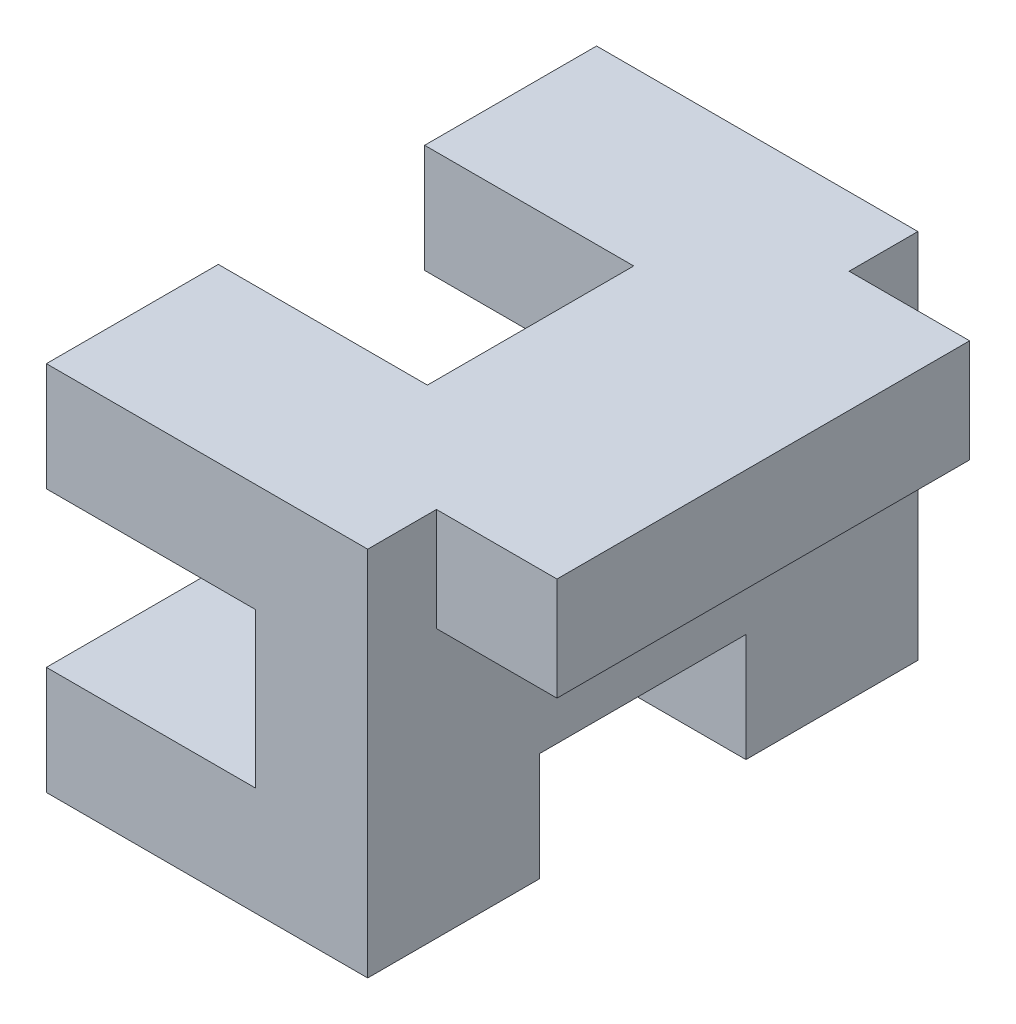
ISO-10303-21;
HEADER;
FILE_DESCRIPTION(('STEP AP214'),'2;1');
FILE_NAME('part.step','',(''),(''),'','','');
FILE_SCHEMA(('AUTOMOTIVE_DESIGN { 1 0 10303 214 1 1 1 1 }'));
ENDSEC;
DATA;
#1=APPLICATION_CONTEXT('core data for automotive mechanical design processes');
#2=APPLICATION_PROTOCOL_DEFINITION('international standard','automotive_design',2000,#1);
#3=PRODUCT_CONTEXT('',#1,'mechanical');
#4=PRODUCT('Part','Part','',(#3));
#5=PRODUCT_RELATED_PRODUCT_CATEGORY('part','',(#4));
#6=PRODUCT_DEFINITION_FORMATION('','',#4);
#7=PRODUCT_DEFINITION_CONTEXT('part definition',#1,'design');
#8=PRODUCT_DEFINITION('design','',#6,#7);
#9=PRODUCT_DEFINITION_SHAPE('','',#8);
#10=(LENGTH_UNIT() NAMED_UNIT(*) SI_UNIT(.MILLI.,.METRE.));
#11=(NAMED_UNIT(*) PLANE_ANGLE_UNIT() SI_UNIT($,.RADIAN.));
#12=(NAMED_UNIT(*) SI_UNIT($,.STERADIAN.) SOLID_ANGLE_UNIT());
#13=UNCERTAINTY_MEASURE_WITH_UNIT(LENGTH_MEASURE(1.E-05),#10,'distance_accuracy_value','');
#14=(GEOMETRIC_REPRESENTATION_CONTEXT(3) GLOBAL_UNCERTAINTY_ASSIGNED_CONTEXT((#13)) GLOBAL_UNIT_ASSIGNED_CONTEXT((#10,
#11,#12)) REPRESENTATION_CONTEXT('',''));
#15=CARTESIAN_POINT('',(0.,0.,0.));
#16=DIRECTION('',(0.,0.,1.));
#17=DIRECTION('',(1.,0.,0.));
#18=AXIS2_PLACEMENT_3D('',#15,#16,#17);
#19=CARTESIAN_POINT('',(-30.1752,-17.145,25.4));
#20=DIRECTION('',(0.,1.,0.));
#21=DIRECTION('',(0.,0.,1.));
#22=AXIS2_PLACEMENT_3D('',#19,#20,#21);
#23=PLANE('',#22);
#24=DIRECTION('',(-1.,0.,0.));
#25=VECTOR('',#24,1.);
#26=CARTESIAN_POINT('',(-30.1752,-17.145,-9.525));
#27=LINE('',#26,#25);
#28=CARTESIAN_POINT('',(0.,-17.145,-9.525));
#29=VERTEX_POINT('',#28);
#30=CARTESIAN_POINT('',(-29.6672,-17.145,-9.525));
#31=VERTEX_POINT('',#30);
#32=EDGE_CURVE('E375',#29,#31,#27,.T.);
#33=ORIENTED_EDGE('',*,*,#32,.T.);
#34=DIRECTION('',(0.,0.,-1.));
#35=VECTOR('',#34,1.);
#36=CARTESIAN_POINT('',(-29.6672,-17.145,25.4));
#37=LINE('',#36,#35);
#38=CARTESIAN_POINT('',(-29.6672,-17.145,-25.4));
#39=VERTEX_POINT('',#38);
#40=EDGE_CURVE('E312',#31,#39,#37,.T.);
#41=ORIENTED_EDGE('',*,*,#40,.T.);
#42=DIRECTION('',(1.,0.,0.));
#43=VECTOR('',#42,1.);
#44=CARTESIAN_POINT('',(-30.1752,-17.145,-25.4));
#45=LINE('',#44,#43);
#46=CARTESIAN_POINT('',(0.,-17.145,-25.4));
#47=VERTEX_POINT('',#46);
#48=EDGE_CURVE('E237',#39,#47,#45,.T.);
#49=ORIENTED_EDGE('',*,*,#48,.T.);
#50=DIRECTION('',(0.,0.,-1.));
#51=VECTOR('',#50,1.);
#52=CARTESIAN_POINT('',(0.,-17.145,25.4));
#53=LINE('',#52,#51);
#54=EDGE_CURVE('E231',#29,#47,#53,.T.);
#55=ORIENTED_EDGE('',*,*,#54,.F.);
#56=EDGE_LOOP('',(#33,#41,#49,#55));
#57=FACE_BOUND('',#56,.T.);
#58=ADVANCED_FACE('F32',(#57),#23,.F.);
#59=CARTESIAN_POINT('',(-30.1752,17.145,25.4));
#60=DIRECTION('',(1.,0.,0.));
#61=DIRECTION('',(0.,1.,0.));
#62=AXIS2_PLACEMENT_3D('',#59,#60,#61);
#63=PLANE('',#62);
#64=DIRECTION('',(0.,0.,-1.));
#65=VECTOR('',#64,1.);
#66=CARTESIAN_POINT('',(-30.1752,16.637,25.4));
#67=LINE('',#66,#65);
#68=CARTESIAN_POINT('',(-30.1752,16.637,-10.033));
#69=VERTEX_POINT('',#68);
#70=CARTESIAN_POINT('',(-30.1752,16.637,-24.892));
#71=VERTEX_POINT('',#70);
#72=EDGE_CURVE('E318',#69,#71,#67,.T.);
#73=ORIENTED_EDGE('',*,*,#72,.T.);
#74=DIRECTION('',(0.,-1.,0.));
#75=VECTOR('',#74,1.);
#76=CARTESIAN_POINT('',(-30.1752,7.13739999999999,-24.892));
#77=LINE('',#76,#75);
#78=CARTESIAN_POINT('',(-30.1752,7.6454,-24.892));
#79=VERTEX_POINT('',#78);
#80=EDGE_CURVE('E320',#71,#79,#77,.T.);
#81=ORIENTED_EDGE('',*,*,#80,.T.);
#82=DIRECTION('',(0.,0.,1.));
#83=VECTOR('',#82,1.);
#84=CARTESIAN_POINT('',(-30.1752,7.6454,25.4));
#85=LINE('',#84,#83);
#86=CARTESIAN_POINT('',(-30.1752,7.6454,-10.033));
#87=VERTEX_POINT('',#86);
#88=EDGE_CURVE('E314',#79,#87,#85,.T.);
#89=ORIENTED_EDGE('',*,*,#88,.T.);
#90=DIRECTION('',(0.,1.,0.));
#91=VECTOR('',#90,1.);
#92=CARTESIAN_POINT('',(-30.1752,17.145,-10.033));
#93=LINE('',#92,#91);
#94=EDGE_CURVE('E316',#87,#69,#93,.T.);
#95=ORIENTED_EDGE('',*,*,#94,.T.);
#96=EDGE_LOOP('',(#73,#81,#89,#95));
#97=FACE_BOUND('',#96,.T.);
#98=ADVANCED_FACE('F500',(#97),#63,.F.);
#99=CARTESIAN_POINT('',(-30.1752,7.13739999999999,25.4));
#100=DIRECTION('',(0.,1.,0.));
#101=DIRECTION('',(0.,0.,1.));
#102=AXIS2_PLACEMENT_3D('',#99,#100,#101);
#103=PLANE('',#102);
#104=DIRECTION('',(-1.,0.,0.));
#105=VECTOR('',#104,1.);
#106=CARTESIAN_POINT('',(-30.1752,7.13739999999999,-9.52499999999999));
#107=LINE('',#106,#105);
#108=CARTESIAN_POINT('',(-10.3632,7.1374,-9.525));
#109=VERTEX_POINT('',#108);
#110=CARTESIAN_POINT('',(-29.6672,7.13739999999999,-9.52499999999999));
#111=VERTEX_POINT('',#110);
#112=EDGE_CURVE('E251',#109,#111,#107,.T.);
#113=ORIENTED_EDGE('',*,*,#112,.T.);
#114=DIRECTION('',(0.,0.,-1.));
#115=VECTOR('',#114,1.);
#116=CARTESIAN_POINT('',(-29.6672000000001,7.13739999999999,25.4));
#117=LINE('',#116,#115);
#118=CARTESIAN_POINT('',(-29.6672,7.13739999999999,-25.4));
#119=VERTEX_POINT('',#118);
#120=EDGE_CURVE('E330',#111,#119,#117,.T.);
#121=ORIENTED_EDGE('',*,*,#120,.T.);
#122=DIRECTION('',(1.,0.,0.));
#123=VECTOR('',#122,1.);
#124=CARTESIAN_POINT('',(-30.1752,7.13739999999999,-25.4));
#125=LINE('',#124,#123);
#126=CARTESIAN_POINT('',(-10.3632,7.1374,-25.4));
#127=VERTEX_POINT('',#126);
#128=EDGE_CURVE('E250',#119,#127,#125,.T.);
#129=ORIENTED_EDGE('',*,*,#128,.T.);
#130=DIRECTION('',(0.,0.,-1.));
#131=VECTOR('',#130,1.);
#132=CARTESIAN_POINT('',(-10.3632,7.1374,25.4));
#133=LINE('',#132,#131);
#134=EDGE_CURVE('E291',#109,#127,#133,.T.);
#135=ORIENTED_EDGE('',*,*,#134,.F.);
#136=EDGE_LOOP('',(#113,#121,#129,#135));
#137=FACE_BOUND('',#136,.T.);
#138=ADVANCED_FACE('F505',(#137),#103,.F.);
#139=CARTESIAN_POINT('',(-10.3632,-7.13740000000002,25.4));
#140=DIRECTION('',(0.,-1.,0.));
#141=DIRECTION('',(1.,0.,0.));
#142=AXIS2_PLACEMENT_3D('',#139,#140,#141);
#143=PLANE('',#142);
#144=DIRECTION('',(-1.,0.,0.));
#145=VECTOR('',#144,1.);
#146=CARTESIAN_POINT('',(-10.3632,-7.13740000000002,-25.4));
#147=LINE('',#146,#145);
#148=CARTESIAN_POINT('',(-10.3632,-7.13740000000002,-25.4));
#149=VERTEX_POINT('',#148);
#150=CARTESIAN_POINT('',(-29.6672,-7.13740000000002,-25.4));
#151=VERTEX_POINT('',#150);
#152=EDGE_CURVE('E262',#149,#151,#147,.T.);
#153=ORIENTED_EDGE('',*,*,#152,.T.);
#154=DIRECTION('',(0.,0.,1.));
#155=VECTOR('',#154,1.);
#156=CARTESIAN_POINT('',(-29.6672,-7.13740000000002,25.4));
#157=LINE('',#156,#155);
#158=CARTESIAN_POINT('',(-29.6672,-7.13740000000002,-9.52499999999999));
#159=VERTEX_POINT('',#158);
#160=EDGE_CURVE('E308',#151,#159,#157,.T.);
#161=ORIENTED_EDGE('',*,*,#160,.T.);
#162=DIRECTION('',(1.,0.,0.));
#163=VECTOR('',#162,1.);
#164=CARTESIAN_POINT('',(-10.3632,-7.13740000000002,-9.525));
#165=LINE('',#164,#163);
#166=CARTESIAN_POINT('',(-10.3632,-7.13740000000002,-9.525));
#167=VERTEX_POINT('',#166);
#168=EDGE_CURVE('E256',#159,#167,#165,.T.);
#169=ORIENTED_EDGE('',*,*,#168,.T.);
#170=DIRECTION('',(0.,0.,-1.));
#171=VECTOR('',#170,1.);
#172=CARTESIAN_POINT('',(-10.3632,-7.13740000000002,25.4));
#173=LINE('',#172,#171);
#174=EDGE_CURVE('E287',#167,#149,#173,.T.);
#175=ORIENTED_EDGE('',*,*,#174,.T.);
#176=EDGE_LOOP('',(#153,#161,#169,#175));
#177=FACE_BOUND('',#176,.T.);
#178=ADVANCED_FACE('F460',(#177),#143,.F.);
#179=CARTESIAN_POINT('',(-30.1752,-7.13740000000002,25.4));
#180=DIRECTION('',(1.,0.,0.));
#181=DIRECTION('',(0.,1.,0.));
#182=AXIS2_PLACEMENT_3D('',#179,#180,#181);
#183=PLANE('',#182);
#184=DIRECTION('',(0.,0.,-1.));
#185=VECTOR('',#184,1.);
#186=CARTESIAN_POINT('',(-30.1752,-7.64540000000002,25.4));
#187=LINE('',#186,#185);
#188=CARTESIAN_POINT('',(-30.1752,-7.64540000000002,-10.033));
#189=VERTEX_POINT('',#188);
#190=CARTESIAN_POINT('',(-30.1752,-7.64540000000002,-24.892));
#191=VERTEX_POINT('',#190);
#192=EDGE_CURVE('E299',#189,#191,#187,.T.);
#193=ORIENTED_EDGE('',*,*,#192,.T.);
#194=DIRECTION('',(0.,-1.,0.));
#195=VECTOR('',#194,1.);
#196=CARTESIAN_POINT('',(-30.1752,-17.145,-24.892));
#197=LINE('',#196,#195);
#198=CARTESIAN_POINT('',(-30.1752,-16.637,-24.892));
#199=VERTEX_POINT('',#198);
#200=EDGE_CURVE('E301',#191,#199,#197,.T.);
#201=ORIENTED_EDGE('',*,*,#200,.T.);
#202=DIRECTION('',(0.,0.,1.));
#203=VECTOR('',#202,1.);
#204=CARTESIAN_POINT('',(-30.1752,-16.637,25.4));
#205=LINE('',#204,#203);
#206=CARTESIAN_POINT('',(-30.1752,-16.637,-10.033));
#207=VERTEX_POINT('',#206);
#208=EDGE_CURVE('E295',#199,#207,#205,.T.);
#209=ORIENTED_EDGE('',*,*,#208,.T.);
#210=DIRECTION('',(0.,1.,0.));
#211=VECTOR('',#210,1.);
#212=CARTESIAN_POINT('',(-30.1752,-7.13740000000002,-10.033));
#213=LINE('',#212,#211);
#214=EDGE_CURVE('E297',#207,#189,#213,.T.);
#215=ORIENTED_EDGE('',*,*,#214,.T.);
#216=EDGE_LOOP('',(#193,#201,#209,#215));
#217=FACE_BOUND('',#216,.T.);
#218=ADVANCED_FACE('F491',(#217),#183,.F.);
#219=CARTESIAN_POINT('',(11.1252,17.145,25.4));
#220=DIRECTION('',(0.,-1.,0.));
#221=DIRECTION('',(1.,0.,0.));
#222=AXIS2_PLACEMENT_3D('',#219,#220,#221);
#223=PLANE('',#222);
#224=DIRECTION('',(0.,0.,-1.));
#225=VECTOR('',#224,1.);
#226=CARTESIAN_POINT('',(11.1252,17.145,25.4));
#227=LINE('',#226,#225);
#228=CARTESIAN_POINT('',(11.1252,17.145,19.05));
#229=VERTEX_POINT('',#228);
#230=CARTESIAN_POINT('',(11.1252,17.145,-19.05));
#231=VERTEX_POINT('',#230);
#232=EDGE_CURVE('E277',#229,#231,#227,.T.);
#233=ORIENTED_EDGE('',*,*,#232,.T.);
#234=DIRECTION('',(1.,0.,0.));
#235=VECTOR('',#234,1.);
#236=CARTESIAN_POINT('',(11.1252,17.145,-19.05));
#237=LINE('',#236,#235);
#238=CARTESIAN_POINT('',(0.,17.145,-19.05));
#239=VERTEX_POINT('',#238);
#240=EDGE_CURVE('E243',#239,#231,#237,.T.);
#241=ORIENTED_EDGE('',*,*,#240,.F.);
#242=DIRECTION('',(0.,0.,1.));
#243=VECTOR('',#242,1.);
#244=CARTESIAN_POINT('',(0.,17.145,-25.4));
#245=LINE('',#244,#243);
#246=CARTESIAN_POINT('',(0.,17.145,-25.4));
#247=VERTEX_POINT('',#246);
#248=EDGE_CURVE('E227',#247,#239,#245,.T.);
#249=ORIENTED_EDGE('',*,*,#248,.F.);
#250=DIRECTION('',(-1.,0.,0.));
#251=VECTOR('',#250,1.);
#252=CARTESIAN_POINT('',(11.1252,17.145,-25.4));
#253=LINE('',#252,#251);
#254=CARTESIAN_POINT('',(-29.6672,17.145,-25.4));
#255=VERTEX_POINT('',#254);
#256=EDGE_CURVE('E241',#247,#255,#253,.T.);
#257=ORIENTED_EDGE('',*,*,#256,.T.);
#258=DIRECTION('',(0.,0.,1.));
#259=VECTOR('',#258,1.);
#260=CARTESIAN_POINT('',(-29.6672000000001,17.145,25.4));
#261=LINE('',#260,#259);
#262=CARTESIAN_POINT('',(-29.6672,17.145,-9.525));
#263=VERTEX_POINT('',#262);
#264=EDGE_CURVE('E326',#255,#263,#261,.T.);
#265=ORIENTED_EDGE('',*,*,#264,.T.);
#266=DIRECTION('',(-1.,0.,0.));
#267=VECTOR('',#266,1.);
#268=CARTESIAN_POINT('',(-30.1752,17.145,-9.525));
#269=LINE('',#268,#267);
#270=CARTESIAN_POINT('',(-10.3632,17.145,-9.525));
#271=VERTEX_POINT('',#270);
#272=EDGE_CURVE('E376',#271,#263,#269,.T.);
#273=ORIENTED_EDGE('',*,*,#272,.F.);
#274=DIRECTION('',(0.,0.,-1.));
#275=VECTOR('',#274,1.);
#276=CARTESIAN_POINT('',(-10.3632,17.145,-9.525));
#277=LINE('',#276,#275);
#278=CARTESIAN_POINT('',(-10.3632,17.145,9.525));
#279=VERTEX_POINT('',#278);
#280=EDGE_CURVE('E442',#279,#271,#277,.T.);
#281=ORIENTED_EDGE('',*,*,#280,.F.);
#282=DIRECTION('',(1.,0.,0.));
#283=VECTOR('',#282,1.);
#284=CARTESIAN_POINT('',(-30.1752,17.145,9.52500000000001));
#285=LINE('',#284,#283);
#286=CARTESIAN_POINT('',(-29.6672,17.145,9.52500000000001));
#287=VERTEX_POINT('',#286);
#288=EDGE_CURVE('E440',#287,#279,#285,.T.);
#289=ORIENTED_EDGE('',*,*,#288,.F.);
#290=DIRECTION('',(0.,0.,1.));
#291=VECTOR('',#290,1.);
#292=CARTESIAN_POINT('',(-29.6672,17.145,25.4));
#293=LINE('',#292,#291);
#294=CARTESIAN_POINT('',(-29.6672000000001,17.145,25.4));
#295=VERTEX_POINT('',#294);
#296=EDGE_CURVE('E323',#287,#295,#293,.T.);
#297=ORIENTED_EDGE('',*,*,#296,.T.);
#298=DIRECTION('',(-1.,0.,0.));
#299=VECTOR('',#298,1.);
#300=CARTESIAN_POINT('',(11.1252,17.145,25.4));
#301=LINE('',#300,#299);
#302=CARTESIAN_POINT('',(0.,17.145,25.4));
#303=VERTEX_POINT('',#302);
#304=EDGE_CURVE('E236',#303,#295,#301,.T.);
#305=ORIENTED_EDGE('',*,*,#304,.F.);
#306=DIRECTION('',(0.,0.,1.));
#307=VECTOR('',#306,1.);
#308=CARTESIAN_POINT('',(0.,17.145,25.4));
#309=LINE('',#308,#307);
#310=CARTESIAN_POINT('',(0.,17.145,19.05));
#311=VERTEX_POINT('',#310);
#312=EDGE_CURVE('E579',#311,#303,#309,.T.);
#313=ORIENTED_EDGE('',*,*,#312,.F.);
#314=DIRECTION('',(-1.,0.,0.));
#315=VECTOR('',#314,1.);
#316=CARTESIAN_POINT('',(11.1252,17.145,19.05));
#317=LINE('',#316,#315);
#318=EDGE_CURVE('E582',#229,#311,#317,.T.);
#319=ORIENTED_EDGE('',*,*,#318,.F.);
#320=EDGE_LOOP('',(#233,#241,#249,#257,#265,#273,#281,#289,#297,#305,#313,#319));
#321=FACE_BOUND('',#320,.T.);
#322=ADVANCED_FACE('F34',(#321),#223,.F.);
#323=DIRECTION('',(0.,0.,1.));
#324=VECTOR('',#323,1.);
#325=CARTESIAN_POINT('',(-30.1752,7.6454,25.4));
#326=LINE('',#325,#324);
#327=CARTESIAN_POINT('',(-30.1752,7.6454,10.033));
#328=VERTEX_POINT('',#327);
#329=CARTESIAN_POINT('',(-30.1752,7.6454,24.892));
#330=VERTEX_POINT('',#329);
#331=EDGE_CURVE('E342',#328,#330,#326,.T.);
#332=ORIENTED_EDGE('',*,*,#331,.T.);
#333=DIRECTION('',(0.,1.,0.));
#334=VECTOR('',#333,1.);
#335=CARTESIAN_POINT('',(-30.1752,17.145,24.892));
#336=LINE('',#335,#334);
#337=CARTESIAN_POINT('',(-30.1752,16.637,24.892));
#338=VERTEX_POINT('',#337);
#339=EDGE_CURVE('E344',#330,#338,#336,.T.);
#340=ORIENTED_EDGE('',*,*,#339,.T.);
#341=DIRECTION('',(0.,0.,-1.));
#342=VECTOR('',#341,1.);
#343=CARTESIAN_POINT('',(-30.1752,16.637,25.4));
#344=LINE('',#343,#342);
#345=CARTESIAN_POINT('',(-30.1752,16.637,10.033));
#346=VERTEX_POINT('',#345);
#347=EDGE_CURVE('E338',#338,#346,#344,.T.);
#348=ORIENTED_EDGE('',*,*,#347,.T.);
#349=DIRECTION('',(0.,-1.,0.));
#350=VECTOR('',#349,1.);
#351=CARTESIAN_POINT('',(-30.1752,17.145,10.033));
#352=LINE('',#351,#350);
#353=EDGE_CURVE('E340',#346,#328,#352,.T.);
#354=ORIENTED_EDGE('',*,*,#353,.T.);
#355=EDGE_LOOP('',(#332,#340,#348,#354));
#356=FACE_BOUND('',#355,.T.);
#357=ADVANCED_FACE('F507',(#356),#63,.F.);
#358=DIRECTION('',(1.,0.,0.));
#359=VECTOR('',#358,1.);
#360=CARTESIAN_POINT('',(-30.1752,7.13739999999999,25.4));
#361=LINE('',#360,#359);
#362=CARTESIAN_POINT('',(-29.6672,7.13739999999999,25.4));
#363=VERTEX_POINT('',#362);
#364=CARTESIAN_POINT('',(-10.3632,7.1374,25.4));
#365=VERTEX_POINT('',#364);
#366=EDGE_CURVE('E267',#363,#365,#361,.T.);
#367=ORIENTED_EDGE('',*,*,#366,.F.);
#368=DIRECTION('',(0.,0.,-1.));
#369=VECTOR('',#368,1.);
#370=CARTESIAN_POINT('',(-29.6672000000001,7.13739999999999,25.4));
#371=LINE('',#370,#369);
#372=CARTESIAN_POINT('',(-29.6672,7.13739999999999,9.52500000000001));
#373=VERTEX_POINT('',#372);
#374=EDGE_CURVE('E347',#363,#373,#371,.T.);
#375=ORIENTED_EDGE('',*,*,#374,.T.);
#376=DIRECTION('',(1.,0.,0.));
#377=VECTOR('',#376,1.);
#378=CARTESIAN_POINT('',(-30.1752,7.13739999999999,9.52500000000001));
#379=LINE('',#378,#377);
#380=CARTESIAN_POINT('',(-10.3632,7.1374,9.525));
#381=VERTEX_POINT('',#380);
#382=EDGE_CURVE('E456',#373,#381,#379,.T.);
#383=ORIENTED_EDGE('',*,*,#382,.T.);
#384=EDGE_CURVE('E292',#365,#381,#133,.T.);
#385=ORIENTED_EDGE('',*,*,#384,.F.);
#386=EDGE_LOOP('',(#367,#375,#383,#385));
#387=FACE_BOUND('',#386,.T.);
#388=ADVANCED_FACE('F534',(#387),#103,.F.);
#389=CARTESIAN_POINT('',(-10.3632,7.1374,25.4));
#390=DIRECTION('',(1.,0.,0.));
#391=DIRECTION('',(0.,1.,0.));
#392=AXIS2_PLACEMENT_3D('',#389,#390,#391);
#393=PLANE('',#392);
#394=ORIENTED_EDGE('',*,*,#174,.F.);
#395=DIRECTION('',(0.,0.,1.));
#396=VECTOR('',#395,1.);
#397=CARTESIAN_POINT('',(-10.3632,-7.13740000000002,25.4));
#398=LINE('',#397,#396);
#399=CARTESIAN_POINT('',(-10.3632,-7.13740000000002,9.525));
#400=VERTEX_POINT('',#399);
#401=EDGE_CURVE('E435',#167,#400,#398,.T.);
#402=ORIENTED_EDGE('',*,*,#401,.T.);
#403=CARTESIAN_POINT('',(-10.3632,-7.13740000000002,25.4));
#404=VERTEX_POINT('',#403);
#405=EDGE_CURVE('E288',#404,#400,#173,.T.);
#406=ORIENTED_EDGE('',*,*,#405,.F.);
#407=DIRECTION('',(0.,-1.,0.));
#408=VECTOR('',#407,1.);
#409=CARTESIAN_POINT('',(-10.3632,7.1374,25.4));
#410=LINE('',#409,#408);
#411=EDGE_CURVE('E269',#365,#404,#410,.T.);
#412=ORIENTED_EDGE('',*,*,#411,.F.);
#413=ORIENTED_EDGE('',*,*,#384,.T.);
#414=DIRECTION('',(0.,1.,0.));
#415=VECTOR('',#414,1.);
#416=CARTESIAN_POINT('',(-10.3632,-17.145,9.525));
#417=LINE('',#416,#415);
#418=EDGE_CURVE('E449',#381,#279,#417,.T.);
#419=ORIENTED_EDGE('',*,*,#418,.T.);
#420=ORIENTED_EDGE('',*,*,#280,.T.);
#421=DIRECTION('',(0.,1.,0.));
#422=VECTOR('',#421,1.);
#423=CARTESIAN_POINT('',(-10.3632,-17.145,-9.525));
#424=LINE('',#423,#422);
#425=EDGE_CURVE('E450',#109,#271,#424,.T.);
#426=ORIENTED_EDGE('',*,*,#425,.F.);
#427=ORIENTED_EDGE('',*,*,#134,.T.);
#428=DIRECTION('',(0.,-1.,0.));
#429=VECTOR('',#428,1.);
#430=CARTESIAN_POINT('',(-10.3632,7.1374,-25.4));
#431=LINE('',#430,#429);
#432=EDGE_CURVE('E253',#127,#149,#431,.T.);
#433=ORIENTED_EDGE('',*,*,#432,.T.);
#434=EDGE_LOOP('',(#394,#402,#406,#412,#413,#419,#420,#426,#427,#433));
#435=FACE_BOUND('',#434,.T.);
#436=ADVANCED_FACE('F472',(#435),#393,.F.);
#437=DIRECTION('',(-1.,0.,0.));
#438=VECTOR('',#437,1.);
#439=CARTESIAN_POINT('',(-10.3632,-7.13740000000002,9.525));
#440=LINE('',#439,#438);
#441=CARTESIAN_POINT('',(-29.6672,-7.13740000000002,9.52500000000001));
#442=VERTEX_POINT('',#441);
#443=EDGE_CURVE('E452',#400,#442,#440,.T.);
#444=ORIENTED_EDGE('',*,*,#443,.T.);
#445=DIRECTION('',(0.,0.,1.));
#446=VECTOR('',#445,1.);
#447=CARTESIAN_POINT('',(-29.6672,-7.13740000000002,25.4));
#448=LINE('',#447,#446);
#449=CARTESIAN_POINT('',(-29.6672,-7.13740000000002,25.4));
#450=VERTEX_POINT('',#449);
#451=EDGE_CURVE('E11',#442,#450,#448,.T.);
#452=ORIENTED_EDGE('',*,*,#451,.T.);
#453=DIRECTION('',(-1.,0.,0.));
#454=VECTOR('',#453,1.);
#455=CARTESIAN_POINT('',(-10.3632,-7.13740000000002,25.4));
#456=LINE('',#455,#454);
#457=EDGE_CURVE('E271',#404,#450,#456,.T.);
#458=ORIENTED_EDGE('',*,*,#457,.F.);
#459=ORIENTED_EDGE('',*,*,#405,.T.);
#460=EDGE_LOOP('',(#444,#452,#458,#459));
#461=FACE_BOUND('',#460,.T.);
#462=ADVANCED_FACE('F517',(#461),#143,.F.);
#463=DIRECTION('',(0.,0.,1.));
#464=VECTOR('',#463,1.);
#465=CARTESIAN_POINT('',(-30.1752,-16.637,25.4));
#466=LINE('',#465,#464);
#467=CARTESIAN_POINT('',(-30.1752,-16.637,10.033));
#468=VERTEX_POINT('',#467);
#469=CARTESIAN_POINT('',(-30.1752,-16.637,24.892));
#470=VERTEX_POINT('',#469);
#471=EDGE_CURVE('E355',#468,#470,#466,.T.);
#472=ORIENTED_EDGE('',*,*,#471,.T.);
#473=DIRECTION('',(0.,1.,0.));
#474=VECTOR('',#473,1.);
#475=CARTESIAN_POINT('',(-30.1752,-7.13740000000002,24.892));
#476=LINE('',#475,#474);
#477=CARTESIAN_POINT('',(-30.1752,-7.64540000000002,24.892));
#478=VERTEX_POINT('',#477);
#479=EDGE_CURVE('E357',#470,#478,#476,.T.);
#480=ORIENTED_EDGE('',*,*,#479,.T.);
#481=DIRECTION('',(0.,0.,-1.));
#482=VECTOR('',#481,1.);
#483=CARTESIAN_POINT('',(-30.1752,-7.64540000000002,25.4));
#484=LINE('',#483,#482);
#485=CARTESIAN_POINT('',(-30.1752,-7.64540000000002,10.033));
#486=VERTEX_POINT('',#485);
#487=EDGE_CURVE('E351',#478,#486,#484,.T.);
#488=ORIENTED_EDGE('',*,*,#487,.T.);
#489=DIRECTION('',(0.,-1.,0.));
#490=VECTOR('',#489,1.);
#491=CARTESIAN_POINT('',(-30.1752,-7.13740000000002,10.033));
#492=LINE('',#491,#490);
#493=EDGE_CURVE('E353',#486,#468,#492,.T.);
#494=ORIENTED_EDGE('',*,*,#493,.T.);
#495=EDGE_LOOP('',(#472,#480,#488,#494));
#496=FACE_BOUND('',#495,.T.);
#497=ADVANCED_FACE('F511',(#496),#183,.F.);
#498=DIRECTION('',(1.,0.,0.));
#499=VECTOR('',#498,1.);
#500=CARTESIAN_POINT('',(-30.1752,-17.145,25.4));
#501=LINE('',#500,#499);
#502=CARTESIAN_POINT('',(-29.6672000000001,-17.145,25.4));
#503=VERTEX_POINT('',#502);
#504=CARTESIAN_POINT('',(0.,-17.145,25.4));
#505=VERTEX_POINT('',#504);
#506=EDGE_CURVE('E274',#503,#505,#501,.T.);
#507=ORIENTED_EDGE('',*,*,#506,.F.);
#508=DIRECTION('',(0.,0.,-1.));
#509=VECTOR('',#508,1.);
#510=CARTESIAN_POINT('',(-29.6672,-17.145,25.4));
#511=LINE('',#510,#509);
#512=CARTESIAN_POINT('',(-29.6672,-17.145,9.52500000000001));
#513=VERTEX_POINT('',#512);
#514=EDGE_CURVE('E360',#503,#513,#511,.T.);
#515=ORIENTED_EDGE('',*,*,#514,.T.);
#516=DIRECTION('',(1.,0.,0.));
#517=VECTOR('',#516,1.);
#518=CARTESIAN_POINT('',(-30.1752,-17.145,9.52500000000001));
#519=LINE('',#518,#517);
#520=CARTESIAN_POINT('',(0.,-17.145,9.525));
#521=VERTEX_POINT('',#520);
#522=EDGE_CURVE('E367',#513,#521,#519,.T.);
#523=ORIENTED_EDGE('',*,*,#522,.T.);
#524=EDGE_CURVE('E285',#505,#521,#53,.T.);
#525=ORIENTED_EDGE('',*,*,#524,.F.);
#526=EDGE_LOOP('',(#507,#515,#523,#525));
#527=FACE_BOUND('',#526,.T.);
#528=ADVANCED_FACE('F365',(#527),#23,.F.);
#529=CARTESIAN_POINT('',(0.,-17.145,25.4));
#530=DIRECTION('',(-1.,0.,0.));
#531=DIRECTION('',(0.,-1.,0.));
#532=AXIS2_PLACEMENT_3D('',#529,#530,#531);
#533=PLANE('',#532);
#534=ORIENTED_EDGE('',*,*,#54,.T.);
#535=DIRECTION('',(0.,1.,0.));
#536=VECTOR('',#535,1.);
#537=CARTESIAN_POINT('',(0.,-17.145,-25.4));
#538=LINE('',#537,#536);
#539=EDGE_CURVE('E223',#47,#247,#538,.T.);
#540=ORIENTED_EDGE('',*,*,#539,.T.);
#541=ORIENTED_EDGE('',*,*,#248,.T.);
#542=DIRECTION('',(0.,1.,0.));
#543=VECTOR('',#542,1.);
#544=CARTESIAN_POINT('',(0.,-17.145,-19.05));
#545=LINE('',#544,#543);
#546=CARTESIAN_POINT('',(0.,7.62,-19.05));
#547=VERTEX_POINT('',#546);
#548=EDGE_CURVE('E589',#547,#239,#545,.T.);
#549=ORIENTED_EDGE('',*,*,#548,.F.);
#550=DIRECTION('',(0.,0.,-1.));
#551=VECTOR('',#550,1.);
#552=CARTESIAN_POINT('',(0.,7.62,25.4));
#553=LINE('',#552,#551);
#554=CARTESIAN_POINT('',(0.,7.62,19.05));
#555=VERTEX_POINT('',#554);
#556=EDGE_CURVE('E282',#555,#547,#553,.T.);
#557=ORIENTED_EDGE('',*,*,#556,.F.);
#558=DIRECTION('',(0.,1.,0.));
#559=VECTOR('',#558,1.);
#560=CARTESIAN_POINT('',(0.,-17.145,19.05));
#561=LINE('',#560,#559);
#562=EDGE_CURVE('E574',#555,#311,#561,.T.);
#563=ORIENTED_EDGE('',*,*,#562,.T.);
#564=ORIENTED_EDGE('',*,*,#312,.T.);
#565=DIRECTION('',(0.,1.,0.));
#566=VECTOR('',#565,1.);
#567=CARTESIAN_POINT('',(0.,-17.145,25.4));
#568=LINE('',#567,#566);
#569=EDGE_CURVE('E47',#505,#303,#568,.T.);
#570=ORIENTED_EDGE('',*,*,#569,.F.);
#571=ORIENTED_EDGE('',*,*,#524,.T.);
#572=DIRECTION('',(0.,-1.,0.));
#573=VECTOR('',#572,1.);
#574=CARTESIAN_POINT('',(0.,-17.145,9.525));
#575=LINE('',#574,#573);
#576=CARTESIAN_POINT('',(0.,-7.13740000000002,9.525));
#577=VERTEX_POINT('',#576);
#578=EDGE_CURVE('E374',#577,#521,#575,.T.);
#579=ORIENTED_EDGE('',*,*,#578,.F.);
#580=DIRECTION('',(0.,0.,1.));
#581=VECTOR('',#580,1.);
#582=CARTESIAN_POINT('',(0.,-7.13740000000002,-9.525));
#583=LINE('',#582,#581);
#584=CARTESIAN_POINT('',(0.,-7.13740000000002,-9.525));
#585=VERTEX_POINT('',#584);
#586=EDGE_CURVE('E428',#585,#577,#583,.T.);
#587=ORIENTED_EDGE('',*,*,#586,.F.);
#588=DIRECTION('',(0.,1.,0.));
#589=VECTOR('',#588,1.);
#590=CARTESIAN_POINT('',(0.,-17.145,-9.525));
#591=LINE('',#590,#589);
#592=EDGE_CURVE('E426',#29,#585,#591,.T.);
#593=ORIENTED_EDGE('',*,*,#592,.F.);
#594=EDGE_LOOP('',(#534,#540,#541,#549,#557,#563,#564,#570,#571,#579,#587,#593));
#595=FACE_BOUND('',#594,.T.);
#596=ADVANCED_FACE('F225',(#595),#533,.F.);
#597=CARTESIAN_POINT('',(0.,7.62,25.4));
#598=DIRECTION('',(0.,1.,0.));
#599=DIRECTION('',(0.,0.,1.));
#600=AXIS2_PLACEMENT_3D('',#597,#598,#599);
#601=PLANE('',#600);
#602=ORIENTED_EDGE('',*,*,#556,.T.);
#603=DIRECTION('',(1.,0.,0.));
#604=VECTOR('',#603,1.);
#605=CARTESIAN_POINT('',(0.,7.62,-19.05));
#606=LINE('',#605,#604);
#607=CARTESIAN_POINT('',(11.1252,7.62,-19.05));
#608=VERTEX_POINT('',#607);
#609=EDGE_CURVE('E585',#547,#608,#606,.T.);
#610=ORIENTED_EDGE('',*,*,#609,.T.);
#611=DIRECTION('',(0.,0.,-1.));
#612=VECTOR('',#611,1.);
#613=CARTESIAN_POINT('',(11.1252,7.62,25.4));
#614=LINE('',#613,#612);
#615=CARTESIAN_POINT('',(11.1252,7.62,19.05));
#616=VERTEX_POINT('',#615);
#617=EDGE_CURVE('E279',#616,#608,#614,.T.);
#618=ORIENTED_EDGE('',*,*,#617,.F.);
#619=DIRECTION('',(-1.,0.,0.));
#620=VECTOR('',#619,1.);
#621=CARTESIAN_POINT('',(0.,7.62,19.05));
#622=LINE('',#621,#620);
#623=EDGE_CURVE('E572',#616,#555,#622,.T.);
#624=ORIENTED_EDGE('',*,*,#623,.T.);
#625=EDGE_LOOP('',(#602,#610,#618,#624));
#626=FACE_BOUND('',#625,.T.);
#627=ADVANCED_FACE('F516',(#626),#601,.F.);
#628=CARTESIAN_POINT('',(11.1252,7.62,25.4));
#629=DIRECTION('',(-1.,0.,0.));
#630=DIRECTION('',(0.,0.,1.));
#631=AXIS2_PLACEMENT_3D('',#628,#629,#630);
#632=PLANE('',#631);
#633=ORIENTED_EDGE('',*,*,#617,.T.);
#634=DIRECTION('',(0.,1.,0.));
#635=VECTOR('',#634,1.);
#636=CARTESIAN_POINT('',(11.1252,-17.145,-19.05));
#637=LINE('',#636,#635);
#638=EDGE_CURVE('E588',#608,#231,#637,.T.);
#639=ORIENTED_EDGE('',*,*,#638,.T.);
#640=ORIENTED_EDGE('',*,*,#232,.F.);
#641=DIRECTION('',(0.,1.,0.));
#642=VECTOR('',#641,1.);
#643=CARTESIAN_POINT('',(11.1252,-17.145,19.05));
#644=LINE('',#643,#642);
#645=EDGE_CURVE('E577',#616,#229,#644,.T.);
#646=ORIENTED_EDGE('',*,*,#645,.F.);
#647=EDGE_LOOP('',(#633,#639,#640,#646));
#648=FACE_BOUND('',#647,.T.);
#649=ADVANCED_FACE('F597',(#648),#632,.F.);
#650=CARTESIAN_POINT('',(11.1252,17.145,25.4));
#651=DIRECTION('',(0.,0.,-1.));
#652=DIRECTION('',(-1.,0.,0.));
#653=AXIS2_PLACEMENT_3D('',#650,#651,#652);
#654=PLANE('',#653);
#655=ORIENTED_EDGE('',*,*,#569,.T.);
#656=ORIENTED_EDGE('',*,*,#304,.T.);
#657=DIRECTION('',(0.,-1.,0.));
#658=VECTOR('',#657,1.);
#659=CARTESIAN_POINT('',(-29.6672,17.145,25.4));
#660=LINE('',#659,#658);
#661=EDGE_CURVE('E335',#295,#363,#660,.T.);
#662=ORIENTED_EDGE('',*,*,#661,.T.);
#663=ORIENTED_EDGE('',*,*,#366,.T.);
#664=ORIENTED_EDGE('',*,*,#411,.T.);
#665=ORIENTED_EDGE('',*,*,#457,.T.);
#666=DIRECTION('',(0.,-1.,0.));
#667=VECTOR('',#666,1.);
#668=CARTESIAN_POINT('',(-29.6672000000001,17.145,25.4));
#669=LINE('',#668,#667);
#670=EDGE_CURVE('E332',#450,#503,#669,.T.);
#671=ORIENTED_EDGE('',*,*,#670,.T.);
#672=ORIENTED_EDGE('',*,*,#506,.T.);
#673=EDGE_LOOP('',(#655,#656,#662,#663,#664,#665,#671,#672));
#674=FACE_BOUND('',#673,.T.);
#675=ADVANCED_FACE('F558',(#674),#654,.F.);
#676=CARTESIAN_POINT('',(11.1252,17.145,-25.4));
#677=DIRECTION('',(0.,0.,-1.));
#678=DIRECTION('',(-1.,0.,0.));
#679=AXIS2_PLACEMENT_3D('',#676,#677,#678);
#680=PLANE('',#679);
#681=ORIENTED_EDGE('',*,*,#256,.F.);
#682=ORIENTED_EDGE('',*,*,#539,.F.);
#683=ORIENTED_EDGE('',*,*,#48,.F.);
#684=DIRECTION('',(0.,1.,0.));
#685=VECTOR('',#684,1.);
#686=CARTESIAN_POINT('',(-29.6672,-7.13740000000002,-25.4));
#687=LINE('',#686,#685);
#688=EDGE_CURVE('E305',#39,#151,#687,.T.);
#689=ORIENTED_EDGE('',*,*,#688,.T.);
#690=ORIENTED_EDGE('',*,*,#152,.F.);
#691=ORIENTED_EDGE('',*,*,#432,.F.);
#692=ORIENTED_EDGE('',*,*,#128,.F.);
#693=DIRECTION('',(0.,1.,0.));
#694=VECTOR('',#693,1.);
#695=CARTESIAN_POINT('',(-29.6672,17.145,-25.4));
#696=LINE('',#695,#694);
#697=EDGE_CURVE('E249',#119,#255,#696,.T.);
#698=ORIENTED_EDGE('',*,*,#697,.T.);
#699=EDGE_LOOP('',(#681,#682,#683,#689,#690,#691,#692,#698));
#700=FACE_BOUND('',#699,.T.);
#701=ADVANCED_FACE('F246',(#700),#680,.T.);
#702=CARTESIAN_POINT('',(-30.1752,-17.145,9.52500000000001));
#703=DIRECTION('',(0.,0.,1.));
#704=DIRECTION('',(1.,0.,0.));
#705=AXIS2_PLACEMENT_3D('',#702,#703,#704);
#706=PLANE('',#705);
#707=ORIENTED_EDGE('',*,*,#522,.F.);
#708=DIRECTION('',(0.,1.,0.));
#709=VECTOR('',#708,1.);
#710=CARTESIAN_POINT('',(-29.6672,-17.145,9.52500000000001));
#711=LINE('',#710,#709);
#712=EDGE_CURVE('E40',#513,#442,#711,.T.);
#713=ORIENTED_EDGE('',*,*,#712,.T.);
#714=ORIENTED_EDGE('',*,*,#443,.F.);
#715=DIRECTION('',(1.,0.,0.));
#716=VECTOR('',#715,1.);
#717=CARTESIAN_POINT('',(-30.1752000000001,-7.13740000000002,9.52500000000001));
#718=LINE('',#717,#716);
#719=EDGE_CURVE('E433',#400,#577,#718,.T.);
#720=ORIENTED_EDGE('',*,*,#719,.T.);
#721=ORIENTED_EDGE('',*,*,#578,.T.);
#722=EDGE_LOOP('',(#707,#713,#714,#720,#721));
#723=FACE_BOUND('',#722,.T.);
#724=ADVANCED_FACE('F372',(#723),#706,.F.);
#725=CARTESIAN_POINT('',(-30.1752,-17.145,-9.525));
#726=DIRECTION('',(0.,0.,-1.));
#727=DIRECTION('',(-1.,0.,0.));
#728=AXIS2_PLACEMENT_3D('',#725,#726,#727);
#729=PLANE('',#728);
#730=ORIENTED_EDGE('',*,*,#168,.F.);
#731=DIRECTION('',(0.,-1.,0.));
#732=VECTOR('',#731,1.);
#733=CARTESIAN_POINT('',(-29.6672,-17.145,-9.525));
#734=LINE('',#733,#732);
#735=EDGE_CURVE('E310',#159,#31,#734,.T.);
#736=ORIENTED_EDGE('',*,*,#735,.T.);
#737=ORIENTED_EDGE('',*,*,#32,.F.);
#738=ORIENTED_EDGE('',*,*,#592,.T.);
#739=DIRECTION('',(1.,0.,0.));
#740=VECTOR('',#739,1.);
#741=CARTESIAN_POINT('',(-30.1752,-7.13740000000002,-9.52499999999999));
#742=LINE('',#741,#740);
#743=EDGE_CURVE('E432',#167,#585,#742,.T.);
#744=ORIENTED_EDGE('',*,*,#743,.F.);
#745=EDGE_LOOP('',(#730,#736,#737,#738,#744));
#746=FACE_BOUND('',#745,.T.);
#747=ADVANCED_FACE('F471',(#746),#729,.F.);
#748=ORIENTED_EDGE('',*,*,#272,.T.);
#749=DIRECTION('',(0.,-1.,0.));
#750=VECTOR('',#749,1.);
#751=CARTESIAN_POINT('',(-29.6672000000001,-17.145,-9.525));
#752=LINE('',#751,#750);
#753=EDGE_CURVE('E328',#263,#111,#752,.T.);
#754=ORIENTED_EDGE('',*,*,#753,.T.);
#755=ORIENTED_EDGE('',*,*,#112,.F.);
#756=ORIENTED_EDGE('',*,*,#425,.T.);
#757=EDGE_LOOP('',(#748,#754,#755,#756));
#758=FACE_BOUND('',#757,.T.);
#759=ADVANCED_FACE('F621',(#758),#729,.F.);
#760=ORIENTED_EDGE('',*,*,#382,.F.);
#761=DIRECTION('',(0.,1.,0.));
#762=VECTOR('',#761,1.);
#763=CARTESIAN_POINT('',(-29.6672000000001,-17.145,9.52500000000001));
#764=LINE('',#763,#762);
#765=EDGE_CURVE('E349',#373,#287,#764,.T.);
#766=ORIENTED_EDGE('',*,*,#765,.T.);
#767=ORIENTED_EDGE('',*,*,#288,.T.);
#768=ORIENTED_EDGE('',*,*,#418,.F.);
#769=EDGE_LOOP('',(#760,#766,#767,#768));
#770=FACE_BOUND('',#769,.T.);
#771=ADVANCED_FACE('F616',(#770),#706,.F.);
#772=CARTESIAN_POINT('',(-30.1752,-7.13740000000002,-9.52499999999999));
#773=DIRECTION('',(0.,1.,0.));
#774=DIRECTION('',(0.,0.,1.));
#775=AXIS2_PLACEMENT_3D('',#772,#773,#774);
#776=PLANE('',#775);
#777=ORIENTED_EDGE('',*,*,#743,.T.);
#778=ORIENTED_EDGE('',*,*,#586,.T.);
#779=ORIENTED_EDGE('',*,*,#719,.F.);
#780=ORIENTED_EDGE('',*,*,#401,.F.);
#781=EDGE_LOOP('',(#777,#778,#779,#780));
#782=FACE_BOUND('',#781,.T.);
#783=ADVANCED_FACE('F467',(#782),#776,.F.);
#784=CARTESIAN_POINT('',(-30.1752,-7.13740000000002,-10.033));
#785=DIRECTION('',(0.707106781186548,0.,-0.707106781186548));
#786=DIRECTION('',(-0.707106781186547,0.,-0.707106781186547));
#787=AXIS2_PLACEMENT_3D('',#784,#785,#786);
#788=PLANE('',#787);
#789=DIRECTION('',(-0.577350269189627,0.577350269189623,-0.577350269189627));
#790=VECTOR('',#789,1.);
#791=CARTESIAN_POINT('',(-18.0255333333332,-28.7866666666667,2.11666666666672));
#792=LINE('',#791,#790);
#793=EDGE_CURVE('E420',#31,#207,#792,.T.);
#794=ORIENTED_EDGE('',*,*,#793,.F.);
#795=ORIENTED_EDGE('',*,*,#735,.F.);
#796=DIRECTION('',(-0.577350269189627,-0.577350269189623,-0.577350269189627));
#797=VECTOR('',#796,1.);
#798=CARTESIAN_POINT('',(-30.0058666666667,-7.47606666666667,-9.86366666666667));
#799=LINE('',#798,#797);
#800=EDGE_CURVE('E423',#189,#159,#799,.F.);
#801=ORIENTED_EDGE('',*,*,#800,.F.);
#802=ORIENTED_EDGE('',*,*,#214,.F.);
#803=EDGE_LOOP('',(#794,#795,#801,#802));
#804=FACE_BOUND('',#803,.T.);
#805=ADVANCED_FACE('F497',(#804),#788,.F.);
#806=CARTESIAN_POINT('',(-30.1752,-7.64540000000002,25.4));
#807=DIRECTION('',(0.707106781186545,-0.70710678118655,0.));
#808=DIRECTION('',(0.70710678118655,0.707106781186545,0.));
#809=AXIS2_PLACEMENT_3D('',#806,#807,#808);
#810=PLANE('',#809);
#811=ORIENTED_EDGE('',*,*,#800,.T.);
#812=ORIENTED_EDGE('',*,*,#160,.F.);
#813=DIRECTION('',(0.577350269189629,0.577350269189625,-0.577350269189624));
#814=VECTOR('',#813,1.);
#815=CARTESIAN_POINT('',(-46.9392,-24.4093999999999,-8.12800000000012));
#816=LINE('',#815,#814);
#817=EDGE_CURVE('E418',#191,#151,#816,.T.);
#818=ORIENTED_EDGE('',*,*,#817,.F.);
#819=ORIENTED_EDGE('',*,*,#192,.F.);
#820=EDGE_LOOP('',(#811,#812,#818,#819));
#821=FACE_BOUND('',#820,.T.);
#822=ADVANCED_FACE('F495',(#821),#810,.F.);
#823=CARTESIAN_POINT('',(-29.6672,-17.145,25.4));
#824=DIRECTION('',(0.707106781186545,0.70710678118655,0.));
#825=DIRECTION('',(-0.70710678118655,0.707106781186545,0.));
#826=AXIS2_PLACEMENT_3D('',#823,#824,#825);
#827=PLANE('',#826);
#828=ORIENTED_EDGE('',*,*,#793,.T.);
#829=ORIENTED_EDGE('',*,*,#208,.F.);
#830=DIRECTION('',(-0.577350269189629,0.577350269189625,0.577350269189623));
#831=VECTOR('',#830,1.);
#832=CARTESIAN_POINT('',(-46.6005333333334,-0.211666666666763,-8.46666666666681));
#833=LINE('',#832,#831);
#834=EDGE_CURVE('E416',#39,#199,#833,.T.);
#835=ORIENTED_EDGE('',*,*,#834,.F.);
#836=ORIENTED_EDGE('',*,*,#40,.F.);
#837=EDGE_LOOP('',(#828,#829,#835,#836));
#838=FACE_BOUND('',#837,.T.);
#839=ADVANCED_FACE('F487',(#838),#827,.F.);
#840=CARTESIAN_POINT('',(-30.1752,-7.13740000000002,-24.892));
#841=DIRECTION('',(-0.707106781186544,0.,-0.707106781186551));
#842=DIRECTION('',(-0.707106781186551,0.,0.707106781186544));
#843=AXIS2_PLACEMENT_3D('',#840,#841,#842);
#844=PLANE('',#843);
#845=ORIENTED_EDGE('',*,*,#817,.T.);
#846=ORIENTED_EDGE('',*,*,#688,.F.);
#847=ORIENTED_EDGE('',*,*,#834,.T.);
#848=ORIENTED_EDGE('',*,*,#200,.F.);
#849=EDGE_LOOP('',(#845,#846,#847,#848));
#850=FACE_BOUND('',#849,.T.);
#851=ADVANCED_FACE('F481',(#850),#844,.T.);
#852=CARTESIAN_POINT('',(-30.1752,17.145,-10.033));
#853=DIRECTION('',(0.707106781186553,0.,-0.707106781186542));
#854=DIRECTION('',(-0.707106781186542,0.,-0.707106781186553));
#855=AXIS2_PLACEMENT_3D('',#852,#853,#854);
#856=PLANE('',#855);
#857=DIRECTION('',(-0.577350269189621,0.577350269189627,-0.57735026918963));
#858=VECTOR('',#857,1.);
#859=CARTESIAN_POINT('',(-18.0255333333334,-4.50426666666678,2.11666666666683));
#860=LINE('',#859,#858);
#861=EDGE_CURVE('E410',#111,#87,#860,.T.);
#862=ORIENTED_EDGE('',*,*,#861,.F.);
#863=ORIENTED_EDGE('',*,*,#753,.F.);
#864=DIRECTION('',(-0.57735026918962,-0.577350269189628,-0.577350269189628));
#865=VECTOR('',#864,1.);
#866=CARTESIAN_POINT('',(-30.0058666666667,16.8063333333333,-9.86366666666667));
#867=LINE('',#866,#865);
#868=EDGE_CURVE('E413',#69,#263,#867,.F.);
#869=ORIENTED_EDGE('',*,*,#868,.F.);
#870=ORIENTED_EDGE('',*,*,#94,.F.);
#871=EDGE_LOOP('',(#862,#863,#869,#870));
#872=FACE_BOUND('',#871,.T.);
#873=ADVANCED_FACE('F625',(#872),#856,.F.);
#874=CARTESIAN_POINT('',(-30.1752,16.637,25.4));
#875=DIRECTION('',(0.707106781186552,-0.707106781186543,0.));
#876=DIRECTION('',(0.707106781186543,0.707106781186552,0.));
#877=AXIS2_PLACEMENT_3D('',#874,#875,#876);
#878=PLANE('',#877);
#879=ORIENTED_EDGE('',*,*,#868,.T.);
#880=ORIENTED_EDGE('',*,*,#264,.F.);
#881=DIRECTION('',(0.577350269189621,0.577350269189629,-0.577350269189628));
#882=VECTOR('',#881,1.);
#883=CARTESIAN_POINT('',(-46.9392,-0.127000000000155,-8.12799999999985));
#884=LINE('',#883,#882);
#885=EDGE_CURVE('E408',#71,#255,#884,.T.);
#886=ORIENTED_EDGE('',*,*,#885,.F.);
#887=ORIENTED_EDGE('',*,*,#72,.F.);
#888=EDGE_LOOP('',(#879,#880,#886,#887));
#889=FACE_BOUND('',#888,.T.);
#890=ADVANCED_FACE('F630',(#889),#878,.F.);
#891=CARTESIAN_POINT('',(-29.6672000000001,7.13739999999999,25.4));
#892=DIRECTION('',(0.707106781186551,0.707106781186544,0.));
#893=DIRECTION('',(-0.707106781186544,0.707106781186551,0.));
#894=AXIS2_PLACEMENT_3D('',#891,#892,#893);
#895=PLANE('',#894);
#896=ORIENTED_EDGE('',*,*,#861,.T.);
#897=ORIENTED_EDGE('',*,*,#88,.F.);
#898=DIRECTION('',(-0.577350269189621,0.577350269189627,0.577350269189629));
#899=VECTOR('',#898,1.);
#900=CARTESIAN_POINT('',(-46.6005333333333,24.0707333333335,-8.46666666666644));
#901=LINE('',#900,#899);
#902=EDGE_CURVE('E406',#119,#79,#901,.T.);
#903=ORIENTED_EDGE('',*,*,#902,.F.);
#904=ORIENTED_EDGE('',*,*,#120,.F.);
#905=EDGE_LOOP('',(#896,#897,#903,#904));
#906=FACE_BOUND('',#905,.T.);
#907=ADVANCED_FACE('F635',(#906),#895,.F.);
#908=CARTESIAN_POINT('',(-30.1752,17.145,-24.892));
#909=DIRECTION('',(-0.707106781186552,0.,-0.707106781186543));
#910=DIRECTION('',(-0.707106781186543,0.,0.707106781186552));
#911=AXIS2_PLACEMENT_3D('',#908,#909,#910);
#912=PLANE('',#911);
#913=ORIENTED_EDGE('',*,*,#885,.T.);
#914=ORIENTED_EDGE('',*,*,#697,.F.);
#915=ORIENTED_EDGE('',*,*,#902,.T.);
#916=ORIENTED_EDGE('',*,*,#80,.F.);
#917=EDGE_LOOP('',(#913,#914,#915,#916));
#918=FACE_BOUND('',#917,.T.);
#919=ADVANCED_FACE('F638',(#918),#912,.T.);
#920=CARTESIAN_POINT('',(-29.6672000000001,-17.145,9.52500000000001));
#921=DIRECTION('',(0.70710678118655,0.,0.707106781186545));
#922=DIRECTION('',(0.707106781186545,0.,-0.70710678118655));
#923=AXIS2_PLACEMENT_3D('',#920,#921,#922);
#924=PLANE('',#923);
#925=DIRECTION('',(-0.577350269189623,0.577350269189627,0.577350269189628));
#926=VECTOR('',#925,1.);
#927=CARTESIAN_POINT('',(-21.5730666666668,-0.956733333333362,1.43086666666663));
#928=LINE('',#927,#926);
#929=EDGE_CURVE('E400',#328,#373,#928,.F.);
#930=ORIENTED_EDGE('',*,*,#929,.F.);
#931=ORIENTED_EDGE('',*,*,#353,.F.);
#932=DIRECTION('',(-0.577350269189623,-0.577350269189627,0.577350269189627));
#933=VECTOR('',#932,1.);
#934=CARTESIAN_POINT('',(-35.2975333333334,11.5146666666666,15.1553333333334));
#935=LINE('',#934,#933);
#936=EDGE_CURVE('E403',#287,#346,#935,.T.);
#937=ORIENTED_EDGE('',*,*,#936,.F.);
#938=ORIENTED_EDGE('',*,*,#765,.F.);
#939=EDGE_LOOP('',(#930,#931,#937,#938));
#940=FACE_BOUND('',#939,.T.);
#941=ADVANCED_FACE('F613',(#940),#924,.F.);
#942=CARTESIAN_POINT('',(-30.1752,16.637,25.4));
#943=DIRECTION('',(0.70710678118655,-0.707106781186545,0.));
#944=DIRECTION('',(0.707106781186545,0.70710678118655,0.));
#945=AXIS2_PLACEMENT_3D('',#942,#943,#944);
#946=PLANE('',#945);
#947=ORIENTED_EDGE('',*,*,#936,.T.);
#948=ORIENTED_EDGE('',*,*,#347,.F.);
#949=DIRECTION('',(0.577350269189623,0.577350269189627,0.577350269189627));
#950=VECTOR('',#949,1.);
#951=CARTESIAN_POINT('',(-30.0058666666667,16.8063333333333,25.0613333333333));
#952=LINE('',#951,#950);
#953=EDGE_CURVE('E398',#295,#338,#952,.F.);
#954=ORIENTED_EDGE('',*,*,#953,.F.);
#955=ORIENTED_EDGE('',*,*,#296,.F.);
#956=EDGE_LOOP('',(#947,#948,#954,#955));
#957=FACE_BOUND('',#956,.T.);
#958=ADVANCED_FACE('F611',(#957),#946,.F.);
#959=CARTESIAN_POINT('',(-29.6672000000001,7.13739999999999,25.4));
#960=DIRECTION('',(0.70710678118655,0.707106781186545,0.));
#961=DIRECTION('',(-0.707106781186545,0.70710678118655,0.));
#962=AXIS2_PLACEMENT_3D('',#959,#960,#961);
#963=PLANE('',#962);
#964=ORIENTED_EDGE('',*,*,#929,.T.);
#965=ORIENTED_EDGE('',*,*,#374,.F.);
#966=DIRECTION('',(-0.577350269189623,0.577350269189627,-0.577350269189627));
#967=VECTOR('',#966,1.);
#968=CARTESIAN_POINT('',(-29.6672000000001,7.13739999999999,25.4));
#969=LINE('',#968,#967);
#970=EDGE_CURVE('E391',#330,#363,#969,.F.);
#971=ORIENTED_EDGE('',*,*,#970,.F.);
#972=ORIENTED_EDGE('',*,*,#331,.F.);
#973=EDGE_LOOP('',(#964,#965,#971,#972));
#974=FACE_BOUND('',#973,.T.);
#975=ADVANCED_FACE('F555',(#974),#963,.F.);
#976=CARTESIAN_POINT('',(-29.6672,17.145,25.4));
#977=DIRECTION('',(0.70710678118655,0.,-0.707106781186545));
#978=DIRECTION('',(-0.707106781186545,0.,-0.70710678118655));
#979=AXIS2_PLACEMENT_3D('',#976,#977,#978);
#980=PLANE('',#979);
#981=ORIENTED_EDGE('',*,*,#953,.T.);
#982=ORIENTED_EDGE('',*,*,#339,.F.);
#983=ORIENTED_EDGE('',*,*,#970,.T.);
#984=ORIENTED_EDGE('',*,*,#661,.F.);
#985=EDGE_LOOP('',(#981,#982,#983,#984));
#986=FACE_BOUND('',#985,.T.);
#987=ADVANCED_FACE('F550',(#986),#980,.F.);
#988=CARTESIAN_POINT('',(-29.6672,-17.145,9.52500000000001));
#989=DIRECTION('',(0.707106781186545,0.,0.70710678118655));
#990=DIRECTION('',(0.70710678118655,0.,-0.707106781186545));
#991=AXIS2_PLACEMENT_3D('',#988,#989,#990);
#992=PLANE('',#991);
#993=DIRECTION('',(-0.577350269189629,0.577350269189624,0.577350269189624));
#994=VECTOR('',#993,1.);
#995=CARTESIAN_POINT('',(-29.6672,-17.145,9.52500000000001));
#996=LINE('',#995,#994);
#997=EDGE_CURVE('E383',#468,#513,#996,.F.);
#998=ORIENTED_EDGE('',*,*,#997,.F.);
#999=ORIENTED_EDGE('',*,*,#493,.F.);
#1000=DIRECTION('',(-0.577350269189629,-0.577350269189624,0.577350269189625));
#1001=VECTOR('',#1000,1.);
#1002=CARTESIAN_POINT('',(-35.2975333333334,-12.7677333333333,15.1553333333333));
#1003=LINE('',#1002,#1001);
#1004=EDGE_CURVE('E386',#442,#486,#1003,.T.);
#1005=ORIENTED_EDGE('',*,*,#1004,.F.);
#1006=ORIENTED_EDGE('',*,*,#712,.F.);
#1007=EDGE_LOOP('',(#998,#999,#1005,#1006));
#1008=FACE_BOUND('',#1007,.T.);
#1009=ADVANCED_FACE('F381',(#1008),#992,.F.);
#1010=CARTESIAN_POINT('',(-30.1752,-7.64540000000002,25.4));
#1011=DIRECTION('',(0.707106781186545,-0.70710678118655,0.));
#1012=DIRECTION('',(0.70710678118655,0.707106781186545,0.));
#1013=AXIS2_PLACEMENT_3D('',#1010,#1011,#1012);
#1014=PLANE('',#1013);
#1015=ORIENTED_EDGE('',*,*,#1004,.T.);
#1016=ORIENTED_EDGE('',*,*,#487,.F.);
#1017=DIRECTION('',(0.577350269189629,0.577350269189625,0.577350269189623));
#1018=VECTOR('',#1017,1.);
#1019=CARTESIAN_POINT('',(-30.0058666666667,-7.47606666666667,25.0613333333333));
#1020=LINE('',#1019,#1018);
#1021=EDGE_CURVE('E389',#450,#478,#1020,.F.);
#1022=ORIENTED_EDGE('',*,*,#1021,.F.);
#1023=ORIENTED_EDGE('',*,*,#451,.F.);
#1024=EDGE_LOOP('',(#1015,#1016,#1022,#1023));
#1025=FACE_BOUND('',#1024,.T.);
#1026=ADVANCED_FACE('F568',(#1025),#1014,.F.);
#1027=CARTESIAN_POINT('',(-29.6672,-17.145,25.4));
#1028=DIRECTION('',(0.707106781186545,0.70710678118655,0.));
#1029=DIRECTION('',(-0.70710678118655,0.707106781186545,0.));
#1030=AXIS2_PLACEMENT_3D('',#1027,#1028,#1029);
#1031=PLANE('',#1030);
#1032=ORIENTED_EDGE('',*,*,#997,.T.);
#1033=ORIENTED_EDGE('',*,*,#514,.F.);
#1034=DIRECTION('',(-0.577350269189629,0.577350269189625,-0.577350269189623));
#1035=VECTOR('',#1034,1.);
#1036=CARTESIAN_POINT('',(-29.6672,-17.145,25.4));
#1037=LINE('',#1036,#1035);
#1038=EDGE_CURVE('E393',#470,#503,#1037,.F.);
#1039=ORIENTED_EDGE('',*,*,#1038,.F.);
#1040=ORIENTED_EDGE('',*,*,#471,.F.);
#1041=EDGE_LOOP('',(#1032,#1033,#1039,#1040));
#1042=FACE_BOUND('',#1041,.T.);
#1043=ADVANCED_FACE('F388',(#1042),#1031,.F.);
#1044=CARTESIAN_POINT('',(-29.6672000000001,17.145,25.4));
#1045=DIRECTION('',(0.707106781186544,0.,-0.707106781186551));
#1046=DIRECTION('',(-0.707106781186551,0.,-0.707106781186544));
#1047=AXIS2_PLACEMENT_3D('',#1044,#1045,#1046);
#1048=PLANE('',#1047);
#1049=ORIENTED_EDGE('',*,*,#1021,.T.);
#1050=ORIENTED_EDGE('',*,*,#479,.F.);
#1051=ORIENTED_EDGE('',*,*,#1038,.T.);
#1052=ORIENTED_EDGE('',*,*,#670,.F.);
#1053=EDGE_LOOP('',(#1049,#1050,#1051,#1052));
#1054=FACE_BOUND('',#1053,.T.);
#1055=ADVANCED_FACE('F571',(#1054),#1048,.F.);
#1056=CARTESIAN_POINT('',(11.1252,-17.145,19.05));
#1057=DIRECTION('',(0.,0.,-1.));
#1058=DIRECTION('',(-1.,0.,0.));
#1059=AXIS2_PLACEMENT_3D('',#1056,#1057,#1058);
#1060=PLANE('',#1059);
#1061=ORIENTED_EDGE('',*,*,#645,.T.);
#1062=ORIENTED_EDGE('',*,*,#318,.T.);
#1063=ORIENTED_EDGE('',*,*,#562,.F.);
#1064=ORIENTED_EDGE('',*,*,#623,.F.);
#1065=EDGE_LOOP('',(#1061,#1062,#1063,#1064));
#1066=FACE_BOUND('',#1065,.T.);
#1067=ADVANCED_FACE('F603',(#1066),#1060,.F.);
#1068=CARTESIAN_POINT('',(11.1252,-17.145,-19.05));
#1069=DIRECTION('',(0.,0.,1.));
#1070=DIRECTION('',(1.,0.,0.));
#1071=AXIS2_PLACEMENT_3D('',#1068,#1069,#1070);
#1072=PLANE('',#1071);
#1073=ORIENTED_EDGE('',*,*,#548,.T.);
#1074=ORIENTED_EDGE('',*,*,#240,.T.);
#1075=ORIENTED_EDGE('',*,*,#638,.F.);
#1076=ORIENTED_EDGE('',*,*,#609,.F.);
#1077=EDGE_LOOP('',(#1073,#1074,#1075,#1076));
#1078=FACE_BOUND('',#1077,.T.);
#1079=ADVANCED_FACE('F594',(#1078),#1072,.F.);
#1080=CLOSED_SHELL('',(#58,#98,#138,#178,#218,#322,#357,#388,#436,#462,#497,#528,#596,#627,#649,
#675,#701,#724,#747,#759,#771,#783,#805,#822,#839,#851,#873,#890,#907,#919,#941,#958,#975,#987,
#1009,#1026,#1043,#1055,#1067,#1079));
#1081=MANIFOLD_SOLID_BREP('B2',#1080);
#1082=ADVANCED_BREP_SHAPE_REPRESENTATION('',(#18,#1081),#14);
#1083=SHAPE_DEFINITION_REPRESENTATION(#9,#1082);
ENDSEC;
END-ISO-10303-21;
